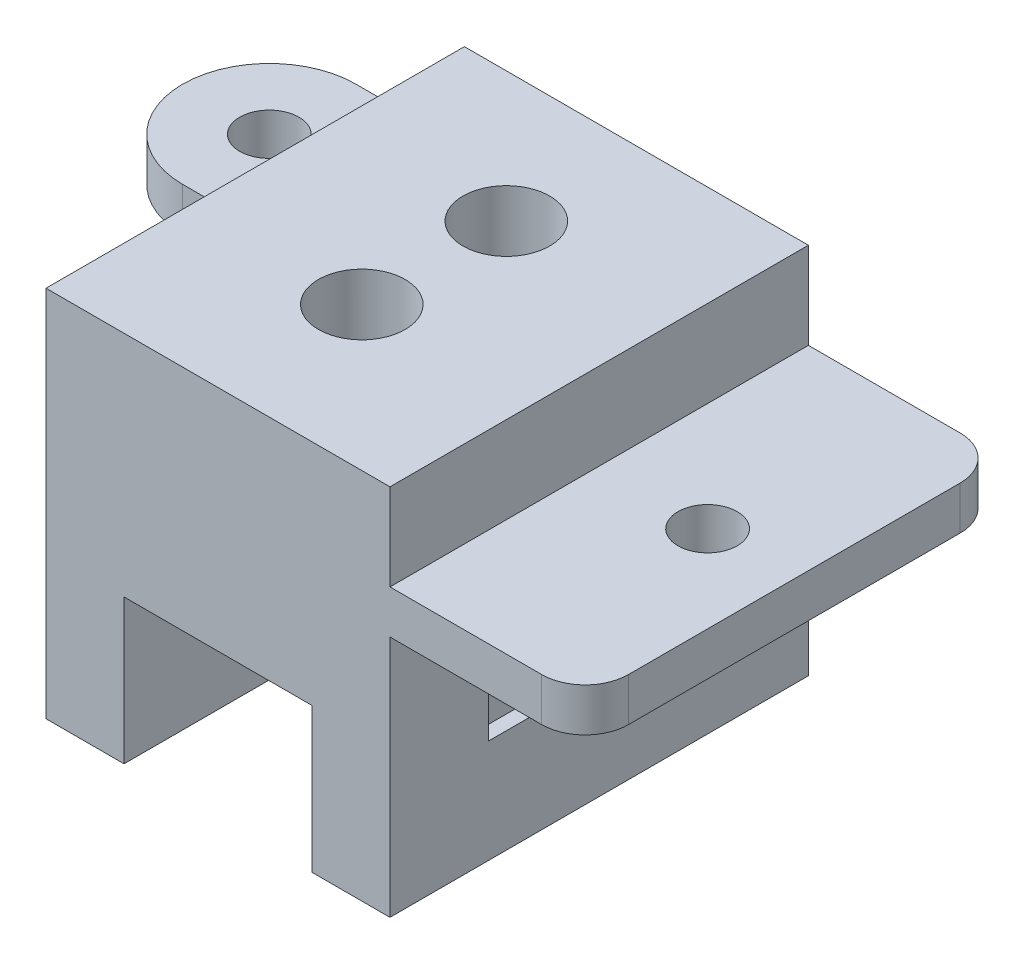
ISO-10303-21;
HEADER;
FILE_DESCRIPTION(('STEP AP214'),'2;1');
FILE_NAME('part.step','',(''),(''),'','','');
FILE_SCHEMA(('AUTOMOTIVE_DESIGN { 1 0 10303 214 1 1 1 1 }'));
ENDSEC;
DATA;
#1=APPLICATION_CONTEXT('core data for automotive mechanical design processes');
#2=APPLICATION_PROTOCOL_DEFINITION('international standard','automotive_design',2000,#1);
#3=PRODUCT_CONTEXT('',#1,'mechanical');
#4=PRODUCT('Part','Part','',(#3));
#5=PRODUCT_RELATED_PRODUCT_CATEGORY('part','',(#4));
#6=PRODUCT_DEFINITION_FORMATION('','',#4);
#7=PRODUCT_DEFINITION_CONTEXT('part definition',#1,'design');
#8=PRODUCT_DEFINITION('design','',#6,#7);
#9=PRODUCT_DEFINITION_SHAPE('','',#8);
#10=(LENGTH_UNIT() NAMED_UNIT(*) SI_UNIT(.MILLI.,.METRE.));
#11=(NAMED_UNIT(*) PLANE_ANGLE_UNIT() SI_UNIT($,.RADIAN.));
#12=(NAMED_UNIT(*) SI_UNIT($,.STERADIAN.) SOLID_ANGLE_UNIT());
#13=UNCERTAINTY_MEASURE_WITH_UNIT(LENGTH_MEASURE(1.E-05),#10,'distance_accuracy_value','');
#14=(GEOMETRIC_REPRESENTATION_CONTEXT(3) GLOBAL_UNCERTAINTY_ASSIGNED_CONTEXT((#13)) GLOBAL_UNIT_ASSIGNED_CONTEXT((#10,
#11,#12)) REPRESENTATION_CONTEXT('',''));
#15=CARTESIAN_POINT('',(0.,0.,0.));
#16=DIRECTION('',(0.,0.,1.));
#17=DIRECTION('',(1.,0.,0.));
#18=AXIS2_PLACEMENT_3D('',#15,#16,#17);
#19=CARTESIAN_POINT('',(23.8,25.8,28.95));
#20=DIRECTION('',(1.,0.,0.));
#21=DIRECTION('',(0.,0.,-1.));
#22=AXIS2_PLACEMENT_3D('',#19,#20,#21);
#23=PLANE('',#22);
#24=DIRECTION('',(0.,-1.,0.));
#25=VECTOR('',#24,1.);
#26=CARTESIAN_POINT('',(23.8,25.8,0.));
#27=LINE('',#26,#25);
#28=CARTESIAN_POINT('',(23.8,16.8,0.));
#29=VERTEX_POINT('',#28);
#30=CARTESIAN_POINT('',(23.8,0.,0.));
#31=VERTEX_POINT('',#30);
#32=EDGE_CURVE('E599',#29,#31,#27,.T.);
#33=ORIENTED_EDGE('',*,*,#32,.F.);
#34=DIRECTION('',(0.,0.,1.));
#35=VECTOR('',#34,1.);
#36=CARTESIAN_POINT('',(23.8,16.8,0.));
#37=LINE('',#36,#35);
#38=CARTESIAN_POINT('',(23.8,16.8,28.95));
#39=VERTEX_POINT('',#38);
#40=EDGE_CURVE('E437',#29,#39,#37,.T.);
#41=ORIENTED_EDGE('',*,*,#40,.T.);
#42=DIRECTION('',(0.,-1.,0.));
#43=VECTOR('',#42,1.);
#44=CARTESIAN_POINT('',(23.8,25.8,28.95));
#45=LINE('',#44,#43);
#46=CARTESIAN_POINT('',(23.8,0.,28.95));
#47=VERTEX_POINT('',#46);
#48=EDGE_CURVE('E566',#39,#47,#45,.T.);
#49=ORIENTED_EDGE('',*,*,#48,.T.);
#50=DIRECTION('',(0.,0.,-1.));
#51=VECTOR('',#50,1.);
#52=CARTESIAN_POINT('',(23.8,0.,28.95));
#53=LINE('',#52,#51);
#54=EDGE_CURVE('E634',#47,#31,#53,.T.);
#55=ORIENTED_EDGE('',*,*,#54,.T.);
#56=EDGE_LOOP('',(#33,#41,#49,#55));
#57=FACE_BOUND('',#56,.T.);
#58=DIRECTION('',(0.,0.,1.));
#59=VECTOR('',#58,1.);
#60=CARTESIAN_POINT('',(23.8,7.15772134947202,22.1382416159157));
#61=LINE('',#60,#59);
#62=CARTESIAN_POINT('',(23.8,7.15772134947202,11.2153485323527));
#63=VERTEX_POINT('',#62);
#64=CARTESIAN_POINT('',(23.8,7.15772134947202,22.1382416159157));
#65=VERTEX_POINT('',#64);
#66=EDGE_CURVE('E318',#63,#65,#61,.T.);
#67=ORIENTED_EDGE('',*,*,#66,.T.);
#68=DIRECTION('',(0.,1.,0.));
#69=VECTOR('',#68,1.);
#70=CARTESIAN_POINT('',(23.8,7.15772134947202,22.1382416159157));
#71=LINE('',#70,#69);
#72=CARTESIAN_POINT('',(23.8,11.6965570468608,22.1382416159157));
#73=VERTEX_POINT('',#72);
#74=EDGE_CURVE('E79',#65,#73,#71,.T.);
#75=ORIENTED_EDGE('',*,*,#74,.T.);
#76=DIRECTION('',(0.,0.,-1.));
#77=VECTOR('',#76,1.);
#78=CARTESIAN_POINT('',(23.8,11.6965570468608,22.1382416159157));
#79=LINE('',#78,#77);
#80=CARTESIAN_POINT('',(23.8,11.6965570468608,11.2153485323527));
#81=VERTEX_POINT('',#80);
#82=EDGE_CURVE('E296',#73,#81,#79,.T.);
#83=ORIENTED_EDGE('',*,*,#82,.T.);
#84=DIRECTION('',(0.,1.,0.));
#85=VECTOR('',#84,1.);
#86=CARTESIAN_POINT('',(23.8,11.6965570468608,11.2153485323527));
#87=LINE('',#86,#85);
#88=CARTESIAN_POINT('',(23.8,13.8570685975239,11.2153485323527));
#89=VERTEX_POINT('',#88);
#90=EDGE_CURVE('E300',#81,#89,#87,.T.);
#91=ORIENTED_EDGE('',*,*,#90,.T.);
#92=DIRECTION('',(0.,-0.690741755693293,-0.723101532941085));
#93=VECTOR('',#92,1.);
#94=CARTESIAN_POINT('',(23.8,13.8570685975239,11.2153485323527));
#95=LINE('',#94,#93);
#96=CARTESIAN_POINT('',(23.8,9.4271391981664,6.5778863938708));
#97=VERTEX_POINT('',#96);
#98=EDGE_CURVE('E329',#89,#97,#95,.T.);
#99=ORIENTED_EDGE('',*,*,#98,.T.);
#100=DIRECTION('',(0.,-0.690741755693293,0.723101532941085));
#101=VECTOR('',#100,1.);
#102=CARTESIAN_POINT('',(23.8,9.4271391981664,6.5778863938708));
#103=LINE('',#102,#101);
#104=CARTESIAN_POINT('',(23.8,4.99720979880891,11.2153485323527));
#105=VERTEX_POINT('',#104);
#106=EDGE_CURVE('E325',#97,#105,#103,.T.);
#107=ORIENTED_EDGE('',*,*,#106,.T.);
#108=DIRECTION('',(0.,1.,0.));
#109=VECTOR('',#108,1.);
#110=CARTESIAN_POINT('',(23.8,4.99720979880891,11.2153485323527));
#111=LINE('',#110,#109);
#112=EDGE_CURVE('E321',#105,#63,#111,.T.);
#113=ORIENTED_EDGE('',*,*,#112,.T.);
#114=EDGE_LOOP('',(#67,#75,#83,#91,#99,#107,#113));
#115=FACE_BOUND('',#114,.T.);
#116=ADVANCED_FACE('F61',(#57,#115),#23,.T.);
#117=CARTESIAN_POINT('',(0.,0.,28.95));
#118=DIRECTION('',(-1.,0.,0.));
#119=DIRECTION('',(0.,0.,1.));
#120=AXIS2_PLACEMENT_3D('',#117,#118,#119);
#121=PLANE('',#120);
#122=DIRECTION('',(0.,1.,0.));
#123=VECTOR('',#122,1.);
#124=CARTESIAN_POINT('',(0.,7.15772134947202,22.1382416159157));
#125=LINE('',#124,#123);
#126=CARTESIAN_POINT('',(0.,7.15772134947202,22.1382416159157));
#127=VERTEX_POINT('',#126);
#128=CARTESIAN_POINT('',(0.,11.6965570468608,22.1382416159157));
#129=VERTEX_POINT('',#128);
#130=EDGE_CURVE('E87',#127,#129,#125,.T.);
#131=ORIENTED_EDGE('',*,*,#130,.F.);
#132=DIRECTION('',(0.,0.,1.));
#133=VECTOR('',#132,1.);
#134=CARTESIAN_POINT('',(0.,7.15772134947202,22.1382416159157));
#135=LINE('',#134,#133);
#136=CARTESIAN_POINT('',(0.,7.15772134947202,11.2153485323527));
#137=VERTEX_POINT('',#136);
#138=EDGE_CURVE('E358',#137,#127,#135,.T.);
#139=ORIENTED_EDGE('',*,*,#138,.F.);
#140=DIRECTION('',(0.,1.,0.));
#141=VECTOR('',#140,1.);
#142=CARTESIAN_POINT('',(0.,4.99720979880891,11.2153485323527));
#143=LINE('',#142,#141);
#144=CARTESIAN_POINT('',(0.,4.99720979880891,11.2153485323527));
#145=VERTEX_POINT('',#144);
#146=EDGE_CURVE('E401',#145,#137,#143,.T.);
#147=ORIENTED_EDGE('',*,*,#146,.F.);
#148=DIRECTION('',(0.,-0.690741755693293,0.723101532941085));
#149=VECTOR('',#148,1.);
#150=CARTESIAN_POINT('',(0.,9.4271391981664,6.5778863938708));
#151=LINE('',#150,#149);
#152=CARTESIAN_POINT('',(0.,9.4271391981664,6.5778863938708));
#153=VERTEX_POINT('',#152);
#154=EDGE_CURVE('E397',#153,#145,#151,.T.);
#155=ORIENTED_EDGE('',*,*,#154,.F.);
#156=DIRECTION('',(0.,-0.690741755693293,-0.723101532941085));
#157=VECTOR('',#156,1.);
#158=CARTESIAN_POINT('',(0.,13.8570685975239,11.2153485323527));
#159=LINE('',#158,#157);
#160=CARTESIAN_POINT('',(0.,13.8570685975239,11.2153485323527));
#161=VERTEX_POINT('',#160);
#162=EDGE_CURVE('E393',#161,#153,#159,.T.);
#163=ORIENTED_EDGE('',*,*,#162,.F.);
#164=DIRECTION('',(0.,1.,0.));
#165=VECTOR('',#164,1.);
#166=CARTESIAN_POINT('',(0.,11.6965570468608,11.2153485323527));
#167=LINE('',#166,#165);
#168=CARTESIAN_POINT('',(0.,11.6965570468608,11.2153485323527));
#169=VERTEX_POINT('',#168);
#170=EDGE_CURVE('E389',#169,#161,#167,.T.);
#171=ORIENTED_EDGE('',*,*,#170,.F.);
#172=DIRECTION('',(0.,0.,-1.));
#173=VECTOR('',#172,1.);
#174=CARTESIAN_POINT('',(0.,11.6965570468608,22.1382416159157));
#175=LINE('',#174,#173);
#176=EDGE_CURVE('E385',#129,#169,#175,.T.);
#177=ORIENTED_EDGE('',*,*,#176,.F.);
#178=EDGE_LOOP('',(#131,#139,#147,#155,#163,#171,#177));
#179=FACE_BOUND('',#178,.T.);
#180=DIRECTION('',(0.,1.,0.));
#181=VECTOR('',#180,1.);
#182=CARTESIAN_POINT('',(0.,0.,0.));
#183=LINE('',#182,#181);
#184=CARTESIAN_POINT('',(0.,19.8,0.));
#185=VERTEX_POINT('',#184);
#186=CARTESIAN_POINT('',(0.,25.8,0.));
#187=VERTEX_POINT('',#186);
#188=EDGE_CURVE('E556',#185,#187,#183,.T.);
#189=ORIENTED_EDGE('',*,*,#188,.F.);
#190=DIRECTION('',(0.,0.,1.));
#191=VECTOR('',#190,1.);
#192=CARTESIAN_POINT('',(0.,19.8,0.));
#193=LINE('',#192,#191);
#194=CARTESIAN_POINT('',(0.,19.8,12.));
#195=VERTEX_POINT('',#194);
#196=EDGE_CURVE('E518',#185,#195,#193,.T.);
#197=ORIENTED_EDGE('',*,*,#196,.T.);
#198=DIRECTION('',(0.,1.,0.));
#199=VECTOR('',#198,1.);
#200=CARTESIAN_POINT('',(0.,16.8,12.));
#201=LINE('',#200,#199);
#202=CARTESIAN_POINT('',(0.,16.8,12.));
#203=VERTEX_POINT('',#202);
#204=EDGE_CURVE('E411',#203,#195,#201,.T.);
#205=ORIENTED_EDGE('',*,*,#204,.F.);
#206=DIRECTION('',(0.,0.,1.));
#207=VECTOR('',#206,1.);
#208=CARTESIAN_POINT('',(0.,16.8,0.));
#209=LINE('',#208,#207);
#210=CARTESIAN_POINT('',(0.,16.8,0.));
#211=VERTEX_POINT('',#210);
#212=EDGE_CURVE('E510',#211,#203,#209,.T.);
#213=ORIENTED_EDGE('',*,*,#212,.F.);
#214=CARTESIAN_POINT('',(0.,0.,0.));
#215=VERTEX_POINT('',#214);
#216=EDGE_CURVE('E591',#215,#211,#183,.T.);
#217=ORIENTED_EDGE('',*,*,#216,.F.);
#218=DIRECTION('',(0.,0.,-1.));
#219=VECTOR('',#218,1.);
#220=CARTESIAN_POINT('',(0.,0.,28.95));
#221=LINE('',#220,#219);
#222=CARTESIAN_POINT('',(0.,0.,28.95));
#223=VERTEX_POINT('',#222);
#224=EDGE_CURVE('E12',#223,#215,#221,.T.);
#225=ORIENTED_EDGE('',*,*,#224,.F.);
#226=DIRECTION('',(0.,1.,0.));
#227=VECTOR('',#226,1.);
#228=CARTESIAN_POINT('',(0.,0.,28.95));
#229=LINE('',#228,#227);
#230=CARTESIAN_POINT('',(0.,25.8,28.95));
#231=VERTEX_POINT('',#230);
#232=EDGE_CURVE('E557',#223,#231,#229,.T.);
#233=ORIENTED_EDGE('',*,*,#232,.T.);
#234=DIRECTION('',(0.,0.,-1.));
#235=VECTOR('',#234,1.);
#236=CARTESIAN_POINT('',(0.,25.8,28.95));
#237=LINE('',#236,#235);
#238=EDGE_CURVE('E65',#231,#187,#237,.T.);
#239=ORIENTED_EDGE('',*,*,#238,.T.);
#240=EDGE_LOOP('',(#189,#197,#205,#213,#217,#225,#233,#239));
#241=FACE_BOUND('',#240,.T.);
#242=ADVANCED_FACE('F63',(#179,#241),#121,.T.);
#243=CARTESIAN_POINT('',(5.4,0.,28.95));
#244=DIRECTION('',(0.,-1.,0.));
#245=DIRECTION('',(0.,0.,-1.));
#246=AXIS2_PLACEMENT_3D('',#243,#244,#245);
#247=PLANE('',#246);
#248=DIRECTION('',(-1.,0.,0.));
#249=VECTOR('',#248,1.);
#250=CARTESIAN_POINT('',(5.4,0.,0.));
#251=LINE('',#250,#249);
#252=CARTESIAN_POINT('',(5.4,0.,0.));
#253=VERTEX_POINT('',#252);
#254=EDGE_CURVE('E562',#253,#215,#251,.T.);
#255=ORIENTED_EDGE('',*,*,#254,.F.);
#256=DIRECTION('',(0.,0.,-1.));
#257=VECTOR('',#256,1.);
#258=CARTESIAN_POINT('',(5.4,0.,28.95));
#259=LINE('',#258,#257);
#260=CARTESIAN_POINT('',(5.4,0.,28.95));
#261=VERTEX_POINT('',#260);
#262=EDGE_CURVE('E71',#261,#253,#259,.T.);
#263=ORIENTED_EDGE('',*,*,#262,.F.);
#264=DIRECTION('',(-1.,0.,0.));
#265=VECTOR('',#264,1.);
#266=CARTESIAN_POINT('',(5.4,0.,28.95));
#267=LINE('',#266,#265);
#268=EDGE_CURVE('E587',#261,#223,#267,.T.);
#269=ORIENTED_EDGE('',*,*,#268,.T.);
#270=ORIENTED_EDGE('',*,*,#224,.T.);
#271=EDGE_LOOP('',(#255,#263,#269,#270));
#272=FACE_BOUND('',#271,.T.);
#273=ADVANCED_FACE('F696',(#272),#247,.T.);
#274=CARTESIAN_POINT('',(5.4,10.,28.95));
#275=DIRECTION('',(1.,0.,0.));
#276=DIRECTION('',(0.,0.,-1.));
#277=AXIS2_PLACEMENT_3D('',#274,#275,#276);
#278=PLANE('',#277);
#279=DIRECTION('',(0.,-1.,0.));
#280=VECTOR('',#279,1.);
#281=CARTESIAN_POINT('',(5.4,10.,0.));
#282=LINE('',#281,#280);
#283=CARTESIAN_POINT('',(5.4,10.,0.));
#284=VERTEX_POINT('',#283);
#285=EDGE_CURVE('E616',#284,#253,#282,.T.);
#286=ORIENTED_EDGE('',*,*,#285,.F.);
#287=DIRECTION('',(0.,0.,-1.));
#288=VECTOR('',#287,1.);
#289=CARTESIAN_POINT('',(5.4,10.,28.95));
#290=LINE('',#289,#288);
#291=CARTESIAN_POINT('',(5.4,10.,28.95));
#292=VERTEX_POINT('',#291);
#293=EDGE_CURVE('E625',#292,#284,#290,.T.);
#294=ORIENTED_EDGE('',*,*,#293,.F.);
#295=DIRECTION('',(0.,-1.,0.));
#296=VECTOR('',#295,1.);
#297=CARTESIAN_POINT('',(5.4,10.,28.95));
#298=LINE('',#297,#296);
#299=EDGE_CURVE('E583',#292,#261,#298,.T.);
#300=ORIENTED_EDGE('',*,*,#299,.T.);
#301=ORIENTED_EDGE('',*,*,#262,.T.);
#302=EDGE_LOOP('',(#286,#294,#300,#301));
#303=FACE_BOUND('',#302,.T.);
#304=ADVANCED_FACE('F700',(#303),#278,.T.);
#305=CARTESIAN_POINT('',(18.4,10.,28.95));
#306=DIRECTION('',(0.,-1.,0.));
#307=DIRECTION('',(0.,0.,-1.));
#308=AXIS2_PLACEMENT_3D('',#305,#306,#307);
#309=PLANE('',#308);
#310=CARTESIAN_POINT('',(11.9,10.,9.));
#311=DIRECTION('',(0.,-1.,0.));
#312=DIRECTION('',(0.,0.,-1.));
#313=AXIS2_PLACEMENT_3D('',#310,#311,#312);
#314=CIRCLE('',#313,3.);
#315=CARTESIAN_POINT('',(11.9,10.,6.));
#316=VERTEX_POINT('',#315);
#317=EDGE_CURVE('E552',#316,#316,#314,.T.);
#318=ORIENTED_EDGE('',*,*,#317,.F.);
#319=EDGE_LOOP('',(#318));
#320=FACE_BOUND('',#319,.T.);
#321=CARTESIAN_POINT('',(11.9,10.,19.));
#322=DIRECTION('',(0.,-1.,0.));
#323=DIRECTION('',(0.,0.,-1.));
#324=AXIS2_PLACEMENT_3D('',#321,#322,#323);
#325=CIRCLE('',#324,3.);
#326=CARTESIAN_POINT('',(11.9,10.,16.));
#327=VERTEX_POINT('',#326);
#328=EDGE_CURVE('E545',#327,#327,#325,.T.);
#329=ORIENTED_EDGE('',*,*,#328,.F.);
#330=EDGE_LOOP('',(#329));
#331=FACE_BOUND('',#330,.T.);
#332=DIRECTION('',(-1.,0.,0.));
#333=VECTOR('',#332,1.);
#334=CARTESIAN_POINT('',(18.4,10.,0.));
#335=LINE('',#334,#333);
#336=CARTESIAN_POINT('',(18.4,10.,0.));
#337=VERTEX_POINT('',#336);
#338=EDGE_CURVE('E612',#337,#284,#335,.T.);
#339=ORIENTED_EDGE('',*,*,#338,.F.);
#340=DIRECTION('',(0.,0.,-1.));
#341=VECTOR('',#340,1.);
#342=CARTESIAN_POINT('',(18.4,10.,28.95));
#343=LINE('',#342,#341);
#344=CARTESIAN_POINT('',(18.4,10.,28.95));
#345=VERTEX_POINT('',#344);
#346=EDGE_CURVE('E628',#345,#337,#343,.T.);
#347=ORIENTED_EDGE('',*,*,#346,.F.);
#348=DIRECTION('',(-1.,0.,0.));
#349=VECTOR('',#348,1.);
#350=CARTESIAN_POINT('',(18.4,10.,28.95));
#351=LINE('',#350,#349);
#352=EDGE_CURVE('E579',#345,#292,#351,.T.);
#353=ORIENTED_EDGE('',*,*,#352,.T.);
#354=ORIENTED_EDGE('',*,*,#293,.T.);
#355=EDGE_LOOP('',(#339,#347,#353,#354));
#356=FACE_BOUND('',#355,.T.);
#357=ADVANCED_FACE('F702',(#320,#331,#356),#309,.T.);
#358=CARTESIAN_POINT('',(18.4,0.,28.95));
#359=DIRECTION('',(-1.,0.,0.));
#360=DIRECTION('',(0.,0.,1.));
#361=AXIS2_PLACEMENT_3D('',#358,#359,#360);
#362=PLANE('',#361);
#363=DIRECTION('',(0.,1.,0.));
#364=VECTOR('',#363,1.);
#365=CARTESIAN_POINT('',(18.4,0.,0.));
#366=LINE('',#365,#364);
#367=CARTESIAN_POINT('',(18.4,0.,0.));
#368=VERTEX_POINT('',#367);
#369=EDGE_CURVE('E608',#368,#337,#366,.T.);
#370=ORIENTED_EDGE('',*,*,#369,.F.);
#371=DIRECTION('',(0.,0.,-1.));
#372=VECTOR('',#371,1.);
#373=CARTESIAN_POINT('',(18.4,0.,28.95));
#374=LINE('',#373,#372);
#375=CARTESIAN_POINT('',(18.4,0.,28.95));
#376=VERTEX_POINT('',#375);
#377=EDGE_CURVE('E631',#376,#368,#374,.T.);
#378=ORIENTED_EDGE('',*,*,#377,.F.);
#379=DIRECTION('',(0.,1.,0.));
#380=VECTOR('',#379,1.);
#381=CARTESIAN_POINT('',(18.4,0.,28.95));
#382=LINE('',#381,#380);
#383=EDGE_CURVE('E575',#376,#345,#382,.T.);
#384=ORIENTED_EDGE('',*,*,#383,.T.);
#385=ORIENTED_EDGE('',*,*,#346,.T.);
#386=EDGE_LOOP('',(#370,#378,#384,#385));
#387=FACE_BOUND('',#386,.T.);
#388=ADVANCED_FACE('F673',(#387),#362,.T.);
#389=CARTESIAN_POINT('',(23.8,0.,28.95));
#390=DIRECTION('',(0.,-1.,0.));
#391=DIRECTION('',(0.,0.,-1.));
#392=AXIS2_PLACEMENT_3D('',#389,#390,#391);
#393=PLANE('',#392);
#394=DIRECTION('',(-1.,0.,0.));
#395=VECTOR('',#394,1.);
#396=CARTESIAN_POINT('',(23.8,0.,0.));
#397=LINE('',#396,#395);
#398=EDGE_CURVE('E604',#31,#368,#397,.T.);
#399=ORIENTED_EDGE('',*,*,#398,.F.);
#400=ORIENTED_EDGE('',*,*,#54,.F.);
#401=DIRECTION('',(-1.,0.,0.));
#402=VECTOR('',#401,1.);
#403=CARTESIAN_POINT('',(23.8,0.,28.95));
#404=LINE('',#403,#402);
#405=EDGE_CURVE('E571',#47,#376,#404,.T.);
#406=ORIENTED_EDGE('',*,*,#405,.T.);
#407=ORIENTED_EDGE('',*,*,#377,.T.);
#408=EDGE_LOOP('',(#399,#400,#406,#407));
#409=FACE_BOUND('',#408,.T.);
#410=ADVANCED_FACE('F666',(#409),#393,.T.);
#411=DIRECTION('',(0.,0.,1.));
#412=VECTOR('',#411,1.);
#413=CARTESIAN_POINT('',(23.8,19.8,0.));
#414=LINE('',#413,#412);
#415=CARTESIAN_POINT('',(23.8,19.8,0.));
#416=VERTEX_POINT('',#415);
#417=CARTESIAN_POINT('',(23.8,19.8,28.95));
#418=VERTEX_POINT('',#417);
#419=EDGE_CURVE('E463',#416,#418,#414,.T.);
#420=ORIENTED_EDGE('',*,*,#419,.F.);
#421=CARTESIAN_POINT('',(23.8,25.8,0.));
#422=VERTEX_POINT('',#421);
#423=EDGE_CURVE('E600',#422,#416,#27,.T.);
#424=ORIENTED_EDGE('',*,*,#423,.F.);
#425=DIRECTION('',(0.,0.,-1.));
#426=VECTOR('',#425,1.);
#427=CARTESIAN_POINT('',(23.8,25.8,28.95));
#428=LINE('',#427,#426);
#429=CARTESIAN_POINT('',(23.8,25.8,28.95));
#430=VERTEX_POINT('',#429);
#431=EDGE_CURVE('E637',#430,#422,#428,.T.);
#432=ORIENTED_EDGE('',*,*,#431,.F.);
#433=EDGE_CURVE('E567',#430,#418,#45,.T.);
#434=ORIENTED_EDGE('',*,*,#433,.T.);
#435=EDGE_LOOP('',(#420,#424,#432,#434));
#436=FACE_BOUND('',#435,.T.);
#437=ADVANCED_FACE('F692',(#436),#23,.T.);
#438=CARTESIAN_POINT('',(0.,25.8,28.95));
#439=DIRECTION('',(0.,1.,0.));
#440=DIRECTION('',(-1.,0.,0.));
#441=AXIS2_PLACEMENT_3D('',#438,#439,#440);
#442=PLANE('',#441);
#443=CARTESIAN_POINT('',(11.9,25.8,9.));
#444=DIRECTION('',(0.,1.,0.));
#445=DIRECTION('',(0.,0.,1.));
#446=AXIS2_PLACEMENT_3D('',#443,#444,#445);
#447=CIRCLE('',#446,3.);
#448=CARTESIAN_POINT('',(11.9,25.8,12.));
#449=VERTEX_POINT('',#448);
#450=EDGE_CURVE('E541',#449,#449,#447,.T.);
#451=ORIENTED_EDGE('',*,*,#450,.F.);
#452=EDGE_LOOP('',(#451));
#453=FACE_BOUND('',#452,.T.);
#454=CARTESIAN_POINT('',(11.9,25.8,19.));
#455=DIRECTION('',(0.,1.,0.));
#456=DIRECTION('',(0.,0.,1.));
#457=AXIS2_PLACEMENT_3D('',#454,#455,#456);
#458=CIRCLE('',#457,3.);
#459=CARTESIAN_POINT('',(11.9,25.8,22.));
#460=VERTEX_POINT('',#459);
#461=EDGE_CURVE('E483',#460,#460,#458,.T.);
#462=ORIENTED_EDGE('',*,*,#461,.F.);
#463=EDGE_LOOP('',(#462));
#464=FACE_BOUND('',#463,.T.);
#465=DIRECTION('',(1.,0.,0.));
#466=VECTOR('',#465,1.);
#467=CARTESIAN_POINT('',(0.,25.8,0.));
#468=LINE('',#467,#466);
#469=EDGE_CURVE('E595',#187,#422,#468,.T.);
#470=ORIENTED_EDGE('',*,*,#469,.F.);
#471=ORIENTED_EDGE('',*,*,#238,.F.);
#472=DIRECTION('',(1.,0.,0.));
#473=VECTOR('',#472,1.);
#474=CARTESIAN_POINT('',(0.,25.8,28.95));
#475=LINE('',#474,#473);
#476=EDGE_CURVE('E561',#231,#430,#475,.T.);
#477=ORIENTED_EDGE('',*,*,#476,.T.);
#478=ORIENTED_EDGE('',*,*,#431,.T.);
#479=EDGE_LOOP('',(#470,#471,#477,#478));
#480=FACE_BOUND('',#479,.T.);
#481=ADVANCED_FACE('F648',(#453,#464,#480),#442,.T.);
#482=CARTESIAN_POINT('',(0.,0.,28.95));
#483=DIRECTION('',(0.,0.,-1.));
#484=DIRECTION('',(-1.,0.,0.));
#485=AXIS2_PLACEMENT_3D('',#482,#483,#484);
#486=PLANE('',#485);
#487=ORIENTED_EDGE('',*,*,#232,.F.);
#488=ORIENTED_EDGE('',*,*,#268,.F.);
#489=ORIENTED_EDGE('',*,*,#299,.F.);
#490=ORIENTED_EDGE('',*,*,#352,.F.);
#491=ORIENTED_EDGE('',*,*,#383,.F.);
#492=ORIENTED_EDGE('',*,*,#405,.F.);
#493=ORIENTED_EDGE('',*,*,#48,.F.);
#494=DIRECTION('',(-1.,0.,0.));
#495=VECTOR('',#494,1.);
#496=CARTESIAN_POINT('',(0.,16.8,28.95));
#497=LINE('',#496,#495);
#498=CARTESIAN_POINT('',(34.3,16.8,28.95));
#499=VERTEX_POINT('',#498);
#500=EDGE_CURVE('E441',#499,#39,#497,.T.);
#501=ORIENTED_EDGE('',*,*,#500,.F.);
#502=DIRECTION('',(0.,1.,0.));
#503=VECTOR('',#502,1.);
#504=CARTESIAN_POINT('',(34.3,16.8,28.95));
#505=LINE('',#504,#503);
#506=CARTESIAN_POINT('',(34.3,19.8,28.95));
#507=VERTEX_POINT('',#506);
#508=EDGE_CURVE('E488',#499,#507,#505,.T.);
#509=ORIENTED_EDGE('',*,*,#508,.T.);
#510=DIRECTION('',(-1.,0.,0.));
#511=VECTOR('',#510,1.);
#512=CARTESIAN_POINT('',(0.,19.8,28.95));
#513=LINE('',#512,#511);
#514=EDGE_CURVE('E467',#507,#418,#513,.T.);
#515=ORIENTED_EDGE('',*,*,#514,.T.);
#516=ORIENTED_EDGE('',*,*,#433,.F.);
#517=ORIENTED_EDGE('',*,*,#476,.F.);
#518=EDGE_LOOP('',(#487,#488,#489,#490,#491,#492,#493,#501,#509,#515,#516,#517));
#519=FACE_BOUND('',#518,.T.);
#520=ADVANCED_FACE('F668',(#519),#486,.F.);
#521=CARTESIAN_POINT('',(0.,0.,0.));
#522=DIRECTION('',(0.,0.,-1.));
#523=DIRECTION('',(-1.,0.,0.));
#524=AXIS2_PLACEMENT_3D('',#521,#522,#523);
#525=PLANE('',#524);
#526=ORIENTED_EDGE('',*,*,#216,.T.);
#527=DIRECTION('',(-1.,0.,0.));
#528=VECTOR('',#527,1.);
#529=CARTESIAN_POINT('',(0.,16.8,0.));
#530=LINE('',#529,#528);
#531=CARTESIAN_POINT('',(-7.5,16.8,0.));
#532=VERTEX_POINT('',#531);
#533=EDGE_CURVE('E504',#211,#532,#530,.T.);
#534=ORIENTED_EDGE('',*,*,#533,.T.);
#535=DIRECTION('',(0.,1.,0.));
#536=VECTOR('',#535,1.);
#537=CARTESIAN_POINT('',(-7.5,16.8,0.));
#538=LINE('',#537,#536);
#539=CARTESIAN_POINT('',(-7.5,19.8,0.));
#540=VERTEX_POINT('',#539);
#541=EDGE_CURVE('E501',#532,#540,#538,.T.);
#542=ORIENTED_EDGE('',*,*,#541,.T.);
#543=DIRECTION('',(-1.,0.,0.));
#544=VECTOR('',#543,1.);
#545=CARTESIAN_POINT('',(0.,19.8,0.));
#546=LINE('',#545,#544);
#547=EDGE_CURVE('E505',#185,#540,#546,.T.);
#548=ORIENTED_EDGE('',*,*,#547,.F.);
#549=ORIENTED_EDGE('',*,*,#188,.T.);
#550=ORIENTED_EDGE('',*,*,#469,.T.);
#551=ORIENTED_EDGE('',*,*,#423,.T.);
#552=DIRECTION('',(1.,0.,0.));
#553=VECTOR('',#552,1.);
#554=CARTESIAN_POINT('',(0.,19.8,0.));
#555=LINE('',#554,#553);
#556=CARTESIAN_POINT('',(34.3,19.8,0.));
#557=VERTEX_POINT('',#556);
#558=EDGE_CURVE('E459',#416,#557,#555,.T.);
#559=ORIENTED_EDGE('',*,*,#558,.T.);
#560=DIRECTION('',(0.,1.,0.));
#561=VECTOR('',#560,1.);
#562=CARTESIAN_POINT('',(34.3,16.8,0.));
#563=LINE('',#562,#561);
#564=CARTESIAN_POINT('',(34.3,16.8,0.));
#565=VERTEX_POINT('',#564);
#566=EDGE_CURVE('E454',#565,#557,#563,.T.);
#567=ORIENTED_EDGE('',*,*,#566,.F.);
#568=DIRECTION('',(1.,0.,0.));
#569=VECTOR('',#568,1.);
#570=CARTESIAN_POINT('',(0.,16.8,0.));
#571=LINE('',#570,#569);
#572=EDGE_CURVE('E433',#29,#565,#571,.T.);
#573=ORIENTED_EDGE('',*,*,#572,.F.);
#574=ORIENTED_EDGE('',*,*,#32,.T.);
#575=ORIENTED_EDGE('',*,*,#398,.T.);
#576=ORIENTED_EDGE('',*,*,#369,.T.);
#577=ORIENTED_EDGE('',*,*,#338,.T.);
#578=ORIENTED_EDGE('',*,*,#285,.T.);
#579=ORIENTED_EDGE('',*,*,#254,.T.);
#580=EDGE_LOOP('',(#526,#534,#542,#548,#549,#550,#551,#559,#567,#573,#574,#575,#576,#577,#578,#579));
#581=FACE_BOUND('',#580,.T.);
#582=ADVANCED_FACE('F650',(#581),#525,.T.);
#583=CARTESIAN_POINT('',(11.9,-2.2,19.));
#584=DIRECTION('',(0.,1.,0.));
#585=DIRECTION('',(0.,0.,1.));
#586=AXIS2_PLACEMENT_3D('',#583,#584,#585);
#587=CYLINDRICAL_SURFACE('',#586,3.);
#588=ORIENTED_EDGE('',*,*,#328,.T.);
#589=EDGE_LOOP('',(#588));
#590=FACE_BOUND('',#589,.T.);
#591=ORIENTED_EDGE('',*,*,#461,.T.);
#592=EDGE_LOOP('',(#591));
#593=FACE_BOUND('',#592,.T.);
#594=ADVANCED_FACE('F757',(#590,#593),#587,.F.);
#595=CARTESIAN_POINT('',(11.9,-2.2,9.));
#596=DIRECTION('',(0.,1.,0.));
#597=DIRECTION('',(0.,0.,1.));
#598=AXIS2_PLACEMENT_3D('',#595,#596,#597);
#599=CYLINDRICAL_SURFACE('',#598,3.);
#600=ORIENTED_EDGE('',*,*,#317,.T.);
#601=EDGE_LOOP('',(#600));
#602=FACE_BOUND('',#601,.T.);
#603=ORIENTED_EDGE('',*,*,#450,.T.);
#604=EDGE_LOOP('',(#603));
#605=FACE_BOUND('',#604,.T.);
#606=ADVANCED_FACE('F761',(#602,#605),#599,.F.);
#607=CARTESIAN_POINT('',(34.3,16.8,3.));
#608=DIRECTION('',(0.,1.,0.));
#609=DIRECTION('',(0.,0.,1.));
#610=AXIS2_PLACEMENT_3D('',#607,#608,#609);
#611=CYLINDRICAL_SURFACE('',#610,3.);
#612=CARTESIAN_POINT('',(34.3,19.8,3.));
#613=DIRECTION('',(0.,1.,0.));
#614=DIRECTION('',(0.,0.,1.));
#615=AXIS2_PLACEMENT_3D('',#612,#613,#614);
#616=CIRCLE('',#615,3.);
#617=CARTESIAN_POINT('',(37.3,19.8,3.00000000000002));
#618=VERTEX_POINT('',#617);
#619=EDGE_CURVE('E455',#557,#618,#616,.F.);
#620=ORIENTED_EDGE('',*,*,#619,.T.);
#621=DIRECTION('',(0.,1.,0.));
#622=VECTOR('',#621,1.);
#623=CARTESIAN_POINT('',(37.3,16.8,3.00000000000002));
#624=LINE('',#623,#622);
#625=CARTESIAN_POINT('',(37.3,16.8,3.00000000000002));
#626=VERTEX_POINT('',#625);
#627=EDGE_CURVE('E479',#626,#618,#624,.T.);
#628=ORIENTED_EDGE('',*,*,#627,.F.);
#629=CARTESIAN_POINT('',(34.3,16.8,3.));
#630=DIRECTION('',(0.,1.,0.));
#631=DIRECTION('',(0.,0.,1.));
#632=AXIS2_PLACEMENT_3D('',#629,#630,#631);
#633=CIRCLE('',#632,3.);
#634=EDGE_CURVE('E429',#565,#626,#633,.F.);
#635=ORIENTED_EDGE('',*,*,#634,.F.);
#636=ORIENTED_EDGE('',*,*,#566,.T.);
#637=EDGE_LOOP('',(#620,#628,#635,#636));
#638=FACE_BOUND('',#637,.T.);
#639=ADVANCED_FACE('F764',(#638),#611,.T.);
#640=CARTESIAN_POINT('',(37.3,16.8,0.));
#641=DIRECTION('',(-1.,0.,0.));
#642=DIRECTION('',(0.,0.,1.));
#643=AXIS2_PLACEMENT_3D('',#640,#641,#642);
#644=PLANE('',#643);
#645=DIRECTION('',(0.,0.,1.));
#646=VECTOR('',#645,1.);
#647=CARTESIAN_POINT('',(37.3,19.8,0.));
#648=LINE('',#647,#646);
#649=CARTESIAN_POINT('',(37.3,19.8,25.95));
#650=VERTEX_POINT('',#649);
#651=EDGE_CURVE('E473',#618,#650,#648,.T.);
#652=ORIENTED_EDGE('',*,*,#651,.T.);
#653=DIRECTION('',(0.,1.,0.));
#654=VECTOR('',#653,1.);
#655=CARTESIAN_POINT('',(37.3,16.8,25.95));
#656=LINE('',#655,#654);
#657=CARTESIAN_POINT('',(37.3,16.8,25.95));
#658=VERTEX_POINT('',#657);
#659=EDGE_CURVE('E484',#658,#650,#656,.T.);
#660=ORIENTED_EDGE('',*,*,#659,.F.);
#661=DIRECTION('',(0.,0.,1.));
#662=VECTOR('',#661,1.);
#663=CARTESIAN_POINT('',(37.3,16.8,0.));
#664=LINE('',#663,#662);
#665=EDGE_CURVE('E447',#626,#658,#664,.T.);
#666=ORIENTED_EDGE('',*,*,#665,.F.);
#667=ORIENTED_EDGE('',*,*,#627,.T.);
#668=EDGE_LOOP('',(#652,#660,#666,#667));
#669=FACE_BOUND('',#668,.T.);
#670=ADVANCED_FACE('F951',(#669),#644,.F.);
#671=CARTESIAN_POINT('',(34.3,16.8,25.95));
#672=DIRECTION('',(0.,1.,0.));
#673=DIRECTION('',(0.,0.,1.));
#674=AXIS2_PLACEMENT_3D('',#671,#672,#673);
#675=CYLINDRICAL_SURFACE('',#674,3.);
#676=CARTESIAN_POINT('',(34.3,19.8,25.95));
#677=DIRECTION('',(0.,1.,0.));
#678=DIRECTION('',(0.,0.,1.));
#679=AXIS2_PLACEMENT_3D('',#676,#677,#678);
#680=CIRCLE('',#679,3.);
#681=EDGE_CURVE('E470',#650,#507,#680,.F.);
#682=ORIENTED_EDGE('',*,*,#681,.T.);
#683=ORIENTED_EDGE('',*,*,#508,.F.);
#684=CARTESIAN_POINT('',(34.3,16.8,25.95));
#685=DIRECTION('',(0.,1.,0.));
#686=DIRECTION('',(0.,0.,1.));
#687=AXIS2_PLACEMENT_3D('',#684,#685,#686);
#688=CIRCLE('',#687,3.);
#689=EDGE_CURVE('E444',#658,#499,#688,.F.);
#690=ORIENTED_EDGE('',*,*,#689,.F.);
#691=ORIENTED_EDGE('',*,*,#659,.T.);
#692=EDGE_LOOP('',(#682,#683,#690,#691));
#693=FACE_BOUND('',#692,.T.);
#694=ADVANCED_FACE('F949',(#693),#675,.T.);
#695=CARTESIAN_POINT('',(31.3,16.8,14.475));
#696=DIRECTION('',(0.,1.,0.));
#697=DIRECTION('',(0.,0.,1.));
#698=AXIS2_PLACEMENT_3D('',#695,#696,#697);
#699=CYLINDRICAL_SURFACE('',#698,2.04999999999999);
#700=CARTESIAN_POINT('',(31.3,16.8,14.475));
#701=DIRECTION('',(0.,1.,0.));
#702=DIRECTION('',(0.,0.,1.));
#703=AXIS2_PLACEMENT_3D('',#700,#701,#702);
#704=CIRCLE('',#703,2.04999999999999);
#705=CARTESIAN_POINT('',(31.3,16.8,16.525));
#706=VERTEX_POINT('',#705);
#707=EDGE_CURVE('E450',#706,#706,#704,.T.);
#708=ORIENTED_EDGE('',*,*,#707,.F.);
#709=EDGE_LOOP('',(#708));
#710=FACE_BOUND('',#709,.T.);
#711=CARTESIAN_POINT('',(31.3,19.8,14.475));
#712=DIRECTION('',(0.,1.,0.));
#713=DIRECTION('',(0.,0.,1.));
#714=AXIS2_PLACEMENT_3D('',#711,#712,#713);
#715=CIRCLE('',#714,2.04999999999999);
#716=CARTESIAN_POINT('',(31.3,19.8,16.525));
#717=VERTEX_POINT('',#716);
#718=EDGE_CURVE('E434',#717,#717,#715,.T.);
#719=ORIENTED_EDGE('',*,*,#718,.T.);
#720=EDGE_LOOP('',(#719));
#721=FACE_BOUND('',#720,.T.);
#722=ADVANCED_FACE('F945',(#710,#721),#699,.F.);
#723=CARTESIAN_POINT('',(0.,16.8,0.));
#724=DIRECTION('',(0.,1.,0.));
#725=DIRECTION('',(0.,0.,1.));
#726=AXIS2_PLACEMENT_3D('',#723,#724,#725);
#727=PLANE('',#726);
#728=ORIENTED_EDGE('',*,*,#634,.T.);
#729=ORIENTED_EDGE('',*,*,#665,.T.);
#730=ORIENTED_EDGE('',*,*,#689,.T.);
#731=ORIENTED_EDGE('',*,*,#500,.T.);
#732=ORIENTED_EDGE('',*,*,#40,.F.);
#733=ORIENTED_EDGE('',*,*,#572,.T.);
#734=EDGE_LOOP('',(#728,#729,#730,#731,#732,#733));
#735=FACE_BOUND('',#734,.T.);
#736=ORIENTED_EDGE('',*,*,#707,.T.);
#737=EDGE_LOOP('',(#736));
#738=FACE_BOUND('',#737,.T.);
#739=ADVANCED_FACE('F678',(#735,#738),#727,.F.);
#740=CARTESIAN_POINT('',(0.,19.8,0.));
#741=DIRECTION('',(0.,1.,0.));
#742=DIRECTION('',(0.,0.,1.));
#743=AXIS2_PLACEMENT_3D('',#740,#741,#742);
#744=PLANE('',#743);
#745=ORIENTED_EDGE('',*,*,#619,.F.);
#746=ORIENTED_EDGE('',*,*,#558,.F.);
#747=ORIENTED_EDGE('',*,*,#419,.T.);
#748=ORIENTED_EDGE('',*,*,#514,.F.);
#749=ORIENTED_EDGE('',*,*,#681,.F.);
#750=ORIENTED_EDGE('',*,*,#651,.F.);
#751=EDGE_LOOP('',(#745,#746,#747,#748,#749,#750));
#752=FACE_BOUND('',#751,.T.);
#753=ORIENTED_EDGE('',*,*,#718,.F.);
#754=EDGE_LOOP('',(#753));
#755=FACE_BOUND('',#754,.T.);
#756=ADVANCED_FACE('F688',(#752,#755),#744,.T.);
#757=CARTESIAN_POINT('',(0.,16.8,12.));
#758=DIRECTION('',(0.,0.,-1.));
#759=DIRECTION('',(-1.,0.,0.));
#760=AXIS2_PLACEMENT_3D('',#757,#758,#759);
#761=PLANE('',#760);
#762=DIRECTION('',(-1.,0.,0.));
#763=VECTOR('',#762,1.);
#764=CARTESIAN_POINT('',(0.,19.8,12.));
#765=LINE('',#764,#763);
#766=CARTESIAN_POINT('',(-7.5,19.8,12.));
#767=VERTEX_POINT('',#766);
#768=EDGE_CURVE('E514',#195,#767,#765,.T.);
#769=ORIENTED_EDGE('',*,*,#768,.T.);
#770=DIRECTION('',(0.,1.,0.));
#771=VECTOR('',#770,1.);
#772=CARTESIAN_POINT('',(-7.5,16.8,12.));
#773=LINE('',#772,#771);
#774=CARTESIAN_POINT('',(-7.5,16.8,12.));
#775=VERTEX_POINT('',#774);
#776=EDGE_CURVE('E498',#775,#767,#773,.T.);
#777=ORIENTED_EDGE('',*,*,#776,.F.);
#778=DIRECTION('',(-1.,0.,0.));
#779=VECTOR('',#778,1.);
#780=CARTESIAN_POINT('',(0.,16.8,12.));
#781=LINE('',#780,#779);
#782=EDGE_CURVE('E529',#203,#775,#781,.T.);
#783=ORIENTED_EDGE('',*,*,#782,.F.);
#784=ORIENTED_EDGE('',*,*,#204,.T.);
#785=EDGE_LOOP('',(#769,#777,#783,#784));
#786=FACE_BOUND('',#785,.T.);
#787=ADVANCED_FACE('F716',(#786),#761,.F.);
#788=CARTESIAN_POINT('',(-7.5,16.8,6.));
#789=DIRECTION('',(0.,1.,0.));
#790=DIRECTION('',(0.,0.,1.));
#791=AXIS2_PLACEMENT_3D('',#788,#789,#790);
#792=CYLINDRICAL_SURFACE('',#791,6.);
#793=CARTESIAN_POINT('',(-7.5,19.8,6.));
#794=DIRECTION('',(0.,1.,0.));
#795=DIRECTION('',(0.,0.,1.));
#796=AXIS2_PLACEMENT_3D('',#793,#794,#795);
#797=CIRCLE('',#796,6.);
#798=EDGE_CURVE('E509',#540,#767,#797,.T.);
#799=ORIENTED_EDGE('',*,*,#798,.F.);
#800=ORIENTED_EDGE('',*,*,#541,.F.);
#801=CARTESIAN_POINT('',(-7.5,16.8,6.));
#802=DIRECTION('',(0.,1.,0.));
#803=DIRECTION('',(0.,0.,1.));
#804=AXIS2_PLACEMENT_3D('',#801,#802,#803);
#805=CIRCLE('',#804,6.);
#806=EDGE_CURVE('E525',#532,#775,#805,.T.);
#807=ORIENTED_EDGE('',*,*,#806,.T.);
#808=ORIENTED_EDGE('',*,*,#776,.T.);
#809=EDGE_LOOP('',(#799,#800,#807,#808));
#810=FACE_BOUND('',#809,.T.);
#811=ADVANCED_FACE('F711',(#810),#792,.T.);
#812=CARTESIAN_POINT('',(-7.5,16.8,6.));
#813=DIRECTION('',(0.,1.,0.));
#814=DIRECTION('',(0.,0.,1.));
#815=AXIS2_PLACEMENT_3D('',#812,#813,#814);
#816=PLANE('',#815);
#817=CARTESIAN_POINT('',(-7.5,16.8,6.));
#818=DIRECTION('',(0.,1.,0.));
#819=DIRECTION('',(0.,0.,1.));
#820=AXIS2_PLACEMENT_3D('',#817,#818,#819);
#821=CIRCLE('',#820,2.05);
#822=CARTESIAN_POINT('',(-7.5,16.8,8.05));
#823=VERTEX_POINT('',#822);
#824=EDGE_CURVE('E521',#823,#823,#821,.T.);
#825=ORIENTED_EDGE('',*,*,#824,.T.);
#826=EDGE_LOOP('',(#825));
#827=FACE_BOUND('',#826,.T.);
#828=ORIENTED_EDGE('',*,*,#212,.T.);
#829=ORIENTED_EDGE('',*,*,#782,.T.);
#830=ORIENTED_EDGE('',*,*,#806,.F.);
#831=ORIENTED_EDGE('',*,*,#533,.F.);
#832=EDGE_LOOP('',(#828,#829,#830,#831));
#833=FACE_BOUND('',#832,.T.);
#834=ADVANCED_FACE('F706',(#827,#833),#816,.F.);
#835=CARTESIAN_POINT('',(-7.5,19.8,6.));
#836=DIRECTION('',(0.,1.,0.));
#837=DIRECTION('',(0.,0.,1.));
#838=AXIS2_PLACEMENT_3D('',#835,#836,#837);
#839=PLANE('',#838);
#840=CARTESIAN_POINT('',(-7.5,19.8,6.));
#841=DIRECTION('',(0.,1.,0.));
#842=DIRECTION('',(0.,0.,1.));
#843=AXIS2_PLACEMENT_3D('',#840,#841,#842);
#844=CIRCLE('',#843,2.05);
#845=CARTESIAN_POINT('',(-7.5,19.8,8.05));
#846=VERTEX_POINT('',#845);
#847=EDGE_CURVE('E460',#846,#846,#844,.T.);
#848=ORIENTED_EDGE('',*,*,#847,.F.);
#849=EDGE_LOOP('',(#848));
#850=FACE_BOUND('',#849,.T.);
#851=ORIENTED_EDGE('',*,*,#196,.F.);
#852=ORIENTED_EDGE('',*,*,#547,.T.);
#853=ORIENTED_EDGE('',*,*,#798,.T.);
#854=ORIENTED_EDGE('',*,*,#768,.F.);
#855=EDGE_LOOP('',(#851,#852,#853,#854));
#856=FACE_BOUND('',#855,.T.);
#857=ADVANCED_FACE('F714',(#850,#856),#839,.T.);
#858=CARTESIAN_POINT('',(-7.5,16.8,6.));
#859=DIRECTION('',(0.,1.,0.));
#860=DIRECTION('',(0.,0.,1.));
#861=AXIS2_PLACEMENT_3D('',#858,#859,#860);
#862=CYLINDRICAL_SURFACE('',#861,2.05);
#863=ORIENTED_EDGE('',*,*,#824,.F.);
#864=EDGE_LOOP('',(#863));
#865=FACE_BOUND('',#864,.T.);
#866=ORIENTED_EDGE('',*,*,#847,.T.);
#867=EDGE_LOOP('',(#866));
#868=FACE_BOUND('',#867,.T.);
#869=ADVANCED_FACE('F766',(#865,#868),#862,.F.);
#870=CARTESIAN_POINT('',(1.,7.15772134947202,22.1382416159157));
#871=DIRECTION('',(0.,0.,1.));
#872=DIRECTION('',(1.,0.,0.));
#873=AXIS2_PLACEMENT_3D('',#870,#871,#872);
#874=PLANE('',#873);
#875=ORIENTED_EDGE('',*,*,#130,.T.);
#876=DIRECTION('',(-1.,0.,0.));
#877=VECTOR('',#876,1.);
#878=CARTESIAN_POINT('',(1.,11.6965570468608,22.1382416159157));
#879=LINE('',#878,#877);
#880=CARTESIAN_POINT('',(1.,11.6965570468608,22.1382416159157));
#881=VERTEX_POINT('',#880);
#882=EDGE_CURVE('E382',#881,#129,#879,.T.);
#883=ORIENTED_EDGE('',*,*,#882,.F.);
#884=DIRECTION('',(0.,1.,0.));
#885=VECTOR('',#884,1.);
#886=CARTESIAN_POINT('',(1.,7.15772134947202,22.1382416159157));
#887=LINE('',#886,#885);
#888=CARTESIAN_POINT('',(1.,7.15772134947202,22.1382416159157));
#889=VERTEX_POINT('',#888);
#890=EDGE_CURVE('E353',#889,#881,#887,.T.);
#891=ORIENTED_EDGE('',*,*,#890,.F.);
#892=DIRECTION('',(-1.,0.,0.));
#893=VECTOR('',#892,1.);
#894=CARTESIAN_POINT('',(1.,7.15772134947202,22.1382416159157));
#895=LINE('',#894,#893);
#896=EDGE_CURVE('E408',#889,#127,#895,.T.);
#897=ORIENTED_EDGE('',*,*,#896,.T.);
#898=EDGE_LOOP('',(#875,#883,#891,#897));
#899=FACE_BOUND('',#898,.T.);
#900=ADVANCED_FACE('F769',(#899),#874,.F.);
#901=CARTESIAN_POINT('',(1.,7.15772134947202,22.1382416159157));
#902=DIRECTION('',(0.,-1.,0.));
#903=DIRECTION('',(0.,0.,-1.));
#904=AXIS2_PLACEMENT_3D('',#901,#902,#903);
#905=PLANE('',#904);
#906=ORIENTED_EDGE('',*,*,#138,.T.);
#907=ORIENTED_EDGE('',*,*,#896,.F.);
#908=DIRECTION('',(0.,0.,1.));
#909=VECTOR('',#908,1.);
#910=CARTESIAN_POINT('',(1.,7.15772134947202,22.1382416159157));
#911=LINE('',#910,#909);
#912=CARTESIAN_POINT('',(1.,7.15772134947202,11.2153485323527));
#913=VERTEX_POINT('',#912);
#914=EDGE_CURVE('E378',#913,#889,#911,.T.);
#915=ORIENTED_EDGE('',*,*,#914,.F.);
#916=DIRECTION('',(-1.,0.,0.));
#917=VECTOR('',#916,1.);
#918=CARTESIAN_POINT('',(1.,7.15772134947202,11.2153485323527));
#919=LINE('',#918,#917);
#920=EDGE_CURVE('E412',#913,#137,#919,.T.);
#921=ORIENTED_EDGE('',*,*,#920,.T.);
#922=EDGE_LOOP('',(#906,#907,#915,#921));
#923=FACE_BOUND('',#922,.T.);
#924=ADVANCED_FACE('F800',(#923),#905,.F.);
#925=CARTESIAN_POINT('',(1.,4.99720979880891,11.2153485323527));
#926=DIRECTION('',(0.,0.,1.));
#927=DIRECTION('',(1.,0.,0.));
#928=AXIS2_PLACEMENT_3D('',#925,#926,#927);
#929=PLANE('',#928);
#930=ORIENTED_EDGE('',*,*,#146,.T.);
#931=ORIENTED_EDGE('',*,*,#920,.F.);
#932=DIRECTION('',(0.,1.,0.));
#933=VECTOR('',#932,1.);
#934=CARTESIAN_POINT('',(1.,4.99720979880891,11.2153485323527));
#935=LINE('',#934,#933);
#936=CARTESIAN_POINT('',(1.,4.99720979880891,11.2153485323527));
#937=VERTEX_POINT('',#936);
#938=EDGE_CURVE('E374',#937,#913,#935,.T.);
#939=ORIENTED_EDGE('',*,*,#938,.F.);
#940=DIRECTION('',(-1.,0.,0.));
#941=VECTOR('',#940,1.);
#942=CARTESIAN_POINT('',(1.,4.99720979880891,11.2153485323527));
#943=LINE('',#942,#941);
#944=EDGE_CURVE('E415',#937,#145,#943,.T.);
#945=ORIENTED_EDGE('',*,*,#944,.T.);
#946=EDGE_LOOP('',(#930,#931,#939,#945));
#947=FACE_BOUND('',#946,.T.);
#948=ADVANCED_FACE('F808',(#947),#929,.F.);
#949=CARTESIAN_POINT('',(1.,9.4271391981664,6.5778863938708));
#950=DIRECTION('',(0.,-0.723101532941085,-0.690741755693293));
#951=DIRECTION('',(0.,0.690741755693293,-0.723101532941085));
#952=AXIS2_PLACEMENT_3D('',#949,#950,#951);
#953=PLANE('',#952);
#954=ORIENTED_EDGE('',*,*,#154,.T.);
#955=ORIENTED_EDGE('',*,*,#944,.F.);
#956=DIRECTION('',(0.,-0.690741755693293,0.723101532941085));
#957=VECTOR('',#956,1.);
#958=CARTESIAN_POINT('',(1.,9.4271391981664,6.5778863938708));
#959=LINE('',#958,#957);
#960=CARTESIAN_POINT('',(1.,9.4271391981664,6.5778863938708));
#961=VERTEX_POINT('',#960);
#962=EDGE_CURVE('E370',#961,#937,#959,.T.);
#963=ORIENTED_EDGE('',*,*,#962,.F.);
#964=DIRECTION('',(-1.,0.,0.));
#965=VECTOR('',#964,1.);
#966=CARTESIAN_POINT('',(1.,9.4271391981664,6.5778863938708));
#967=LINE('',#966,#965);
#968=EDGE_CURVE('E418',#961,#153,#967,.T.);
#969=ORIENTED_EDGE('',*,*,#968,.T.);
#970=EDGE_LOOP('',(#954,#955,#963,#969));
#971=FACE_BOUND('',#970,.T.);
#972=ADVANCED_FACE('F817',(#971),#953,.F.);
#973=CARTESIAN_POINT('',(1.,13.8570685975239,11.2153485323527));
#974=DIRECTION('',(0.,0.723101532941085,-0.690741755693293));
#975=DIRECTION('',(0.,0.690741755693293,0.723101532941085));
#976=AXIS2_PLACEMENT_3D('',#973,#974,#975);
#977=PLANE('',#976);
#978=ORIENTED_EDGE('',*,*,#162,.T.);
#979=ORIENTED_EDGE('',*,*,#968,.F.);
#980=DIRECTION('',(0.,-0.690741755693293,-0.723101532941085));
#981=VECTOR('',#980,1.);
#982=CARTESIAN_POINT('',(1.,13.8570685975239,11.2153485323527));
#983=LINE('',#982,#981);
#984=CARTESIAN_POINT('',(1.,13.8570685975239,11.2153485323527));
#985=VERTEX_POINT('',#984);
#986=EDGE_CURVE('E366',#985,#961,#983,.T.);
#987=ORIENTED_EDGE('',*,*,#986,.F.);
#988=DIRECTION('',(-1.,0.,0.));
#989=VECTOR('',#988,1.);
#990=CARTESIAN_POINT('',(1.,13.8570685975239,11.2153485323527));
#991=LINE('',#990,#989);
#992=EDGE_CURVE('E421',#985,#161,#991,.T.);
#993=ORIENTED_EDGE('',*,*,#992,.T.);
#994=EDGE_LOOP('',(#978,#979,#987,#993));
#995=FACE_BOUND('',#994,.T.);
#996=ADVANCED_FACE('F826',(#995),#977,.F.);
#997=CARTESIAN_POINT('',(1.,11.6965570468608,11.2153485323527));
#998=DIRECTION('',(0.,0.,1.));
#999=DIRECTION('',(1.,0.,0.));
#1000=AXIS2_PLACEMENT_3D('',#997,#998,#999);
#1001=PLANE('',#1000);
#1002=ORIENTED_EDGE('',*,*,#170,.T.);
#1003=ORIENTED_EDGE('',*,*,#992,.F.);
#1004=DIRECTION('',(0.,1.,0.));
#1005=VECTOR('',#1004,1.);
#1006=CARTESIAN_POINT('',(1.,11.6965570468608,11.2153485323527));
#1007=LINE('',#1006,#1005);
#1008=CARTESIAN_POINT('',(1.,11.6965570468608,11.2153485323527));
#1009=VERTEX_POINT('',#1008);
#1010=EDGE_CURVE('E362',#1009,#985,#1007,.T.);
#1011=ORIENTED_EDGE('',*,*,#1010,.F.);
#1012=DIRECTION('',(-1.,0.,0.));
#1013=VECTOR('',#1012,1.);
#1014=CARTESIAN_POINT('',(1.,11.6965570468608,11.2153485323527));
#1015=LINE('',#1014,#1013);
#1016=EDGE_CURVE('E424',#1009,#169,#1015,.T.);
#1017=ORIENTED_EDGE('',*,*,#1016,.T.);
#1018=EDGE_LOOP('',(#1002,#1003,#1011,#1017));
#1019=FACE_BOUND('',#1018,.T.);
#1020=ADVANCED_FACE('F835',(#1019),#1001,.F.);
#1021=CARTESIAN_POINT('',(1.,11.6965570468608,22.1382416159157));
#1022=DIRECTION('',(0.,1.,0.));
#1023=DIRECTION('',(0.,0.,1.));
#1024=AXIS2_PLACEMENT_3D('',#1021,#1022,#1023);
#1025=PLANE('',#1024);
#1026=ORIENTED_EDGE('',*,*,#176,.T.);
#1027=ORIENTED_EDGE('',*,*,#1016,.F.);
#1028=DIRECTION('',(0.,0.,-1.));
#1029=VECTOR('',#1028,1.);
#1030=CARTESIAN_POINT('',(1.,11.6965570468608,22.1382416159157));
#1031=LINE('',#1030,#1029);
#1032=EDGE_CURVE('E357',#881,#1009,#1031,.T.);
#1033=ORIENTED_EDGE('',*,*,#1032,.F.);
#1034=ORIENTED_EDGE('',*,*,#882,.T.);
#1035=EDGE_LOOP('',(#1026,#1027,#1033,#1034));
#1036=FACE_BOUND('',#1035,.T.);
#1037=ADVANCED_FACE('F844',(#1036),#1025,.F.);
#1038=CARTESIAN_POINT('',(1.,0.,0.));
#1039=DIRECTION('',(-1.,0.,0.));
#1040=DIRECTION('',(0.,0.,1.));
#1041=AXIS2_PLACEMENT_3D('',#1038,#1039,#1040);
#1042=PLANE('',#1041);
#1043=ORIENTED_EDGE('',*,*,#890,.T.);
#1044=ORIENTED_EDGE('',*,*,#1032,.T.);
#1045=ORIENTED_EDGE('',*,*,#1010,.T.);
#1046=ORIENTED_EDGE('',*,*,#986,.T.);
#1047=ORIENTED_EDGE('',*,*,#962,.T.);
#1048=ORIENTED_EDGE('',*,*,#938,.T.);
#1049=ORIENTED_EDGE('',*,*,#914,.T.);
#1050=EDGE_LOOP('',(#1043,#1044,#1045,#1046,#1047,#1048,#1049));
#1051=FACE_BOUND('',#1050,.T.);
#1052=ADVANCED_FACE('F852',(#1051),#1042,.T.);
#1053=CARTESIAN_POINT('',(22.8,7.15772134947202,22.1382416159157));
#1054=DIRECTION('',(0.,0.,-1.));
#1055=DIRECTION('',(-1.,0.,0.));
#1056=AXIS2_PLACEMENT_3D('',#1053,#1054,#1055);
#1057=PLANE('',#1056);
#1058=ORIENTED_EDGE('',*,*,#74,.F.);
#1059=DIRECTION('',(1.,0.,0.));
#1060=VECTOR('',#1059,1.);
#1061=CARTESIAN_POINT('',(22.8,7.15772134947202,22.1382416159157));
#1062=LINE('',#1061,#1060);
#1063=CARTESIAN_POINT('',(22.8,7.15772134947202,22.1382416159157));
#1064=VERTEX_POINT('',#1063);
#1065=EDGE_CURVE('E277',#1064,#65,#1062,.T.);
#1066=ORIENTED_EDGE('',*,*,#1065,.F.);
#1067=DIRECTION('',(0.,1.,0.));
#1068=VECTOR('',#1067,1.);
#1069=CARTESIAN_POINT('',(22.8,7.15772134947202,22.1382416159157));
#1070=LINE('',#1069,#1068);
#1071=CARTESIAN_POINT('',(22.8,11.6965570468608,22.1382416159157));
#1072=VERTEX_POINT('',#1071);
#1073=EDGE_CURVE('E285',#1064,#1072,#1070,.T.);
#1074=ORIENTED_EDGE('',*,*,#1073,.T.);
#1075=DIRECTION('',(1.,0.,0.));
#1076=VECTOR('',#1075,1.);
#1077=CARTESIAN_POINT('',(22.8,11.6965570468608,22.1382416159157));
#1078=LINE('',#1077,#1076);
#1079=EDGE_CURVE('E336',#1072,#73,#1078,.T.);
#1080=ORIENTED_EDGE('',*,*,#1079,.T.);
#1081=EDGE_LOOP('',(#1058,#1066,#1074,#1080));
#1082=FACE_BOUND('',#1081,.T.);
#1083=ADVANCED_FACE('F288',(#1082),#1057,.T.);
#1084=CARTESIAN_POINT('',(22.8,11.6965570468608,22.1382416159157));
#1085=DIRECTION('',(0.,-1.,0.));
#1086=DIRECTION('',(0.,0.,-1.));
#1087=AXIS2_PLACEMENT_3D('',#1084,#1085,#1086);
#1088=PLANE('',#1087);
#1089=ORIENTED_EDGE('',*,*,#82,.F.);
#1090=ORIENTED_EDGE('',*,*,#1079,.F.);
#1091=DIRECTION('',(0.,0.,-1.));
#1092=VECTOR('',#1091,1.);
#1093=CARTESIAN_POINT('',(22.8,11.6965570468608,22.1382416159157));
#1094=LINE('',#1093,#1092);
#1095=CARTESIAN_POINT('',(22.8,11.6965570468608,11.2153485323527));
#1096=VERTEX_POINT('',#1095);
#1097=EDGE_CURVE('E291',#1072,#1096,#1094,.T.);
#1098=ORIENTED_EDGE('',*,*,#1097,.T.);
#1099=DIRECTION('',(1.,0.,0.));
#1100=VECTOR('',#1099,1.);
#1101=CARTESIAN_POINT('',(22.8,11.6965570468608,11.2153485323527));
#1102=LINE('',#1101,#1100);
#1103=EDGE_CURVE('E339',#1096,#81,#1102,.T.);
#1104=ORIENTED_EDGE('',*,*,#1103,.T.);
#1105=EDGE_LOOP('',(#1089,#1090,#1098,#1104));
#1106=FACE_BOUND('',#1105,.T.);
#1107=ADVANCED_FACE('F875',(#1106),#1088,.T.);
#1108=CARTESIAN_POINT('',(22.8,11.6965570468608,11.2153485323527));
#1109=DIRECTION('',(0.,0.,-1.));
#1110=DIRECTION('',(-1.,0.,0.));
#1111=AXIS2_PLACEMENT_3D('',#1108,#1109,#1110);
#1112=PLANE('',#1111);
#1113=ORIENTED_EDGE('',*,*,#90,.F.);
#1114=ORIENTED_EDGE('',*,*,#1103,.F.);
#1115=DIRECTION('',(0.,1.,0.));
#1116=VECTOR('',#1115,1.);
#1117=CARTESIAN_POINT('',(22.8,11.6965570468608,11.2153485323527));
#1118=LINE('',#1117,#1116);
#1119=CARTESIAN_POINT('',(22.8,13.8570685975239,11.2153485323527));
#1120=VERTEX_POINT('',#1119);
#1121=EDGE_CURVE('E311',#1096,#1120,#1118,.T.);
#1122=ORIENTED_EDGE('',*,*,#1121,.T.);
#1123=DIRECTION('',(1.,0.,0.));
#1124=VECTOR('',#1123,1.);
#1125=CARTESIAN_POINT('',(22.8,13.8570685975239,11.2153485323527));
#1126=LINE('',#1125,#1124);
#1127=EDGE_CURVE('E342',#1120,#89,#1126,.T.);
#1128=ORIENTED_EDGE('',*,*,#1127,.T.);
#1129=EDGE_LOOP('',(#1113,#1114,#1122,#1128));
#1130=FACE_BOUND('',#1129,.T.);
#1131=ADVANCED_FACE('F884',(#1130),#1112,.T.);
#1132=CARTESIAN_POINT('',(22.8,13.8570685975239,11.2153485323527));
#1133=DIRECTION('',(0.,-0.723101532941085,0.690741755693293));
#1134=DIRECTION('',(0.,-0.690741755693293,-0.723101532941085));
#1135=AXIS2_PLACEMENT_3D('',#1132,#1133,#1134);
#1136=PLANE('',#1135);
#1137=ORIENTED_EDGE('',*,*,#98,.F.);
#1138=ORIENTED_EDGE('',*,*,#1127,.F.);
#1139=DIRECTION('',(0.,-0.690741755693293,-0.723101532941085));
#1140=VECTOR('',#1139,1.);
#1141=CARTESIAN_POINT('',(22.8,13.8570685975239,11.2153485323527));
#1142=LINE('',#1141,#1140);
#1143=CARTESIAN_POINT('',(22.8,9.4271391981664,6.5778863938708));
#1144=VERTEX_POINT('',#1143);
#1145=EDGE_CURVE('E308',#1120,#1144,#1142,.T.);
#1146=ORIENTED_EDGE('',*,*,#1145,.T.);
#1147=DIRECTION('',(1.,0.,0.));
#1148=VECTOR('',#1147,1.);
#1149=CARTESIAN_POINT('',(22.8,9.4271391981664,6.5778863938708));
#1150=LINE('',#1149,#1148);
#1151=EDGE_CURVE('E345',#1144,#97,#1150,.T.);
#1152=ORIENTED_EDGE('',*,*,#1151,.T.);
#1153=EDGE_LOOP('',(#1137,#1138,#1146,#1152));
#1154=FACE_BOUND('',#1153,.T.);
#1155=ADVANCED_FACE('F894',(#1154),#1136,.T.);
#1156=CARTESIAN_POINT('',(22.8,9.4271391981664,6.5778863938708));
#1157=DIRECTION('',(0.,0.723101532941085,0.690741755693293));
#1158=DIRECTION('',(0.,-0.690741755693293,0.723101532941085));
#1159=AXIS2_PLACEMENT_3D('',#1156,#1157,#1158);
#1160=PLANE('',#1159);
#1161=ORIENTED_EDGE('',*,*,#106,.F.);
#1162=ORIENTED_EDGE('',*,*,#1151,.F.);
#1163=DIRECTION('',(0.,-0.690741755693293,0.723101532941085));
#1164=VECTOR('',#1163,1.);
#1165=CARTESIAN_POINT('',(22.8,9.4271391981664,6.5778863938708));
#1166=LINE('',#1165,#1164);
#1167=CARTESIAN_POINT('',(22.8,4.99720979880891,11.2153485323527));
#1168=VERTEX_POINT('',#1167);
#1169=EDGE_CURVE('E305',#1144,#1168,#1166,.T.);
#1170=ORIENTED_EDGE('',*,*,#1169,.T.);
#1171=DIRECTION('',(1.,0.,0.));
#1172=VECTOR('',#1171,1.);
#1173=CARTESIAN_POINT('',(22.8,4.99720979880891,11.2153485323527));
#1174=LINE('',#1173,#1172);
#1175=EDGE_CURVE('E348',#1168,#105,#1174,.T.);
#1176=ORIENTED_EDGE('',*,*,#1175,.T.);
#1177=EDGE_LOOP('',(#1161,#1162,#1170,#1176));
#1178=FACE_BOUND('',#1177,.T.);
#1179=ADVANCED_FACE('F904',(#1178),#1160,.T.);
#1180=CARTESIAN_POINT('',(22.8,4.99720979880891,11.2153485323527));
#1181=DIRECTION('',(0.,0.,-1.));
#1182=DIRECTION('',(-1.,0.,0.));
#1183=AXIS2_PLACEMENT_3D('',#1180,#1181,#1182);
#1184=PLANE('',#1183);
#1185=ORIENTED_EDGE('',*,*,#112,.F.);
#1186=ORIENTED_EDGE('',*,*,#1175,.F.);
#1187=DIRECTION('',(0.,1.,0.));
#1188=VECTOR('',#1187,1.);
#1189=CARTESIAN_POINT('',(22.8,4.99720979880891,11.2153485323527));
#1190=LINE('',#1189,#1188);
#1191=CARTESIAN_POINT('',(22.8,7.15772134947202,11.2153485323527));
#1192=VERTEX_POINT('',#1191);
#1193=EDGE_CURVE('E284',#1168,#1192,#1190,.T.);
#1194=ORIENTED_EDGE('',*,*,#1193,.T.);
#1195=DIRECTION('',(1.,0.,0.));
#1196=VECTOR('',#1195,1.);
#1197=CARTESIAN_POINT('',(22.8,7.15772134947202,11.2153485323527));
#1198=LINE('',#1197,#1196);
#1199=EDGE_CURVE('E279',#1192,#63,#1198,.T.);
#1200=ORIENTED_EDGE('',*,*,#1199,.T.);
#1201=EDGE_LOOP('',(#1185,#1186,#1194,#1200));
#1202=FACE_BOUND('',#1201,.T.);
#1203=ADVANCED_FACE('F914',(#1202),#1184,.T.);
#1204=CARTESIAN_POINT('',(22.8,7.15772134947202,22.1382416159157));
#1205=DIRECTION('',(0.,1.,0.));
#1206=DIRECTION('',(0.,0.,1.));
#1207=AXIS2_PLACEMENT_3D('',#1204,#1205,#1206);
#1208=PLANE('',#1207);
#1209=ORIENTED_EDGE('',*,*,#66,.F.);
#1210=ORIENTED_EDGE('',*,*,#1199,.F.);
#1211=DIRECTION('',(0.,0.,1.));
#1212=VECTOR('',#1211,1.);
#1213=CARTESIAN_POINT('',(22.8,7.15772134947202,22.1382416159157));
#1214=LINE('',#1213,#1212);
#1215=EDGE_CURVE('E274',#1192,#1064,#1214,.T.);
#1216=ORIENTED_EDGE('',*,*,#1215,.T.);
#1217=ORIENTED_EDGE('',*,*,#1065,.T.);
#1218=EDGE_LOOP('',(#1209,#1210,#1216,#1217));
#1219=FACE_BOUND('',#1218,.T.);
#1220=ADVANCED_FACE('F276',(#1219),#1208,.T.);
#1221=CARTESIAN_POINT('',(22.8,0.,0.));
#1222=DIRECTION('',(1.,0.,0.));
#1223=DIRECTION('',(0.,0.,1.));
#1224=AXIS2_PLACEMENT_3D('',#1221,#1222,#1223);
#1225=PLANE('',#1224);
#1226=ORIENTED_EDGE('',*,*,#1073,.F.);
#1227=ORIENTED_EDGE('',*,*,#1215,.F.);
#1228=ORIENTED_EDGE('',*,*,#1193,.F.);
#1229=ORIENTED_EDGE('',*,*,#1169,.F.);
#1230=ORIENTED_EDGE('',*,*,#1145,.F.);
#1231=ORIENTED_EDGE('',*,*,#1121,.F.);
#1232=ORIENTED_EDGE('',*,*,#1097,.F.);
#1233=EDGE_LOOP('',(#1226,#1227,#1228,#1229,#1230,#1231,#1232));
#1234=FACE_BOUND('',#1233,.T.);
#1235=ADVANCED_FACE('F293',(#1234),#1225,.T.);
#1236=CLOSED_SHELL('',(#116,#242,#273,#304,#357,#388,#410,#437,#481,#520,#582,#594,#606,#639,
#670,#694,#722,#739,#756,#787,#811,#834,#857,#869,#900,#924,#948,#972,#996,#1020,#1037,#1052,
#1083,#1107,#1131,#1155,#1179,#1203,#1220,#1235));
#1237=MANIFOLD_SOLID_BREP('B2',#1236);
#1238=ADVANCED_BREP_SHAPE_REPRESENTATION('',(#18,#1237),#14);
#1239=SHAPE_DEFINITION_REPRESENTATION(#9,#1238);
ENDSEC;
END-ISO-10303-21;
